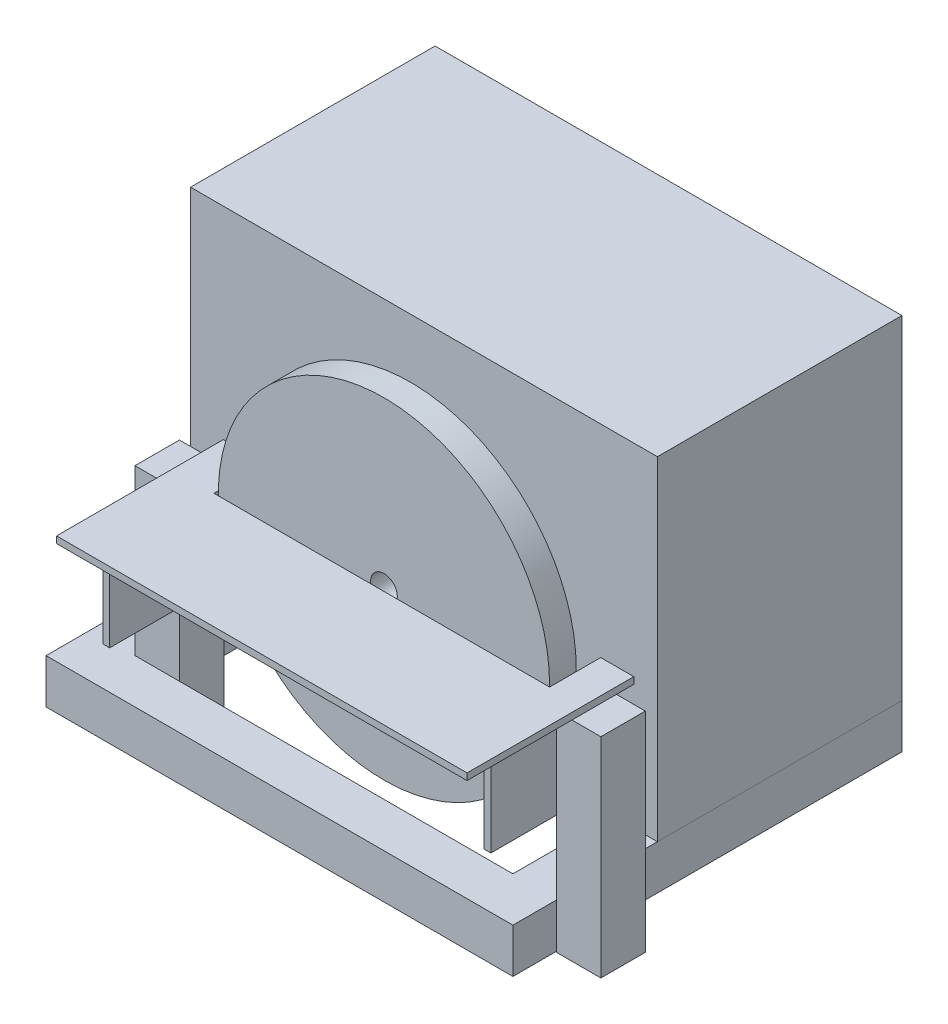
from build123d import *

# Parameters (mm, degrees)
BOSS_EXTRUDE1_DEPTH  = 20
SKETCH2_W            = 210
SKETCH2_H            = 110
BOSS_EXTRUDE2_DEPTH  = 150
SKETCH3_R            = 4
BOSS_EXTRUDE3_DEPTH  = 28
SKETCH4_R            = 18.5
BOSS_EXTRUDE4_DEPTH  = 5
SKETCH5_R            = 6
BOSS_EXTRUDE5_DEPTH  = 2
SKETCH6_R            = 74.5
SKETCH6_R_2          = 6
BOSS_EXTRUDE6_DEPTH  = 12
BOSS_EXTRUDE7_DEPTH  = 3
SKETCH8_W            = 33.700562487
SKETCH8_H            = 8.628747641
BOSS_EXTRUDE8_DEPTH  = 3
SKETCH9_R            = 2.424853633
BOSS_EXTRUDE9_DEPTH  = 3
SKETCH10_W           = 20
SKETCH10_H           = 94
BOSS_EXTRUDE10_DEPTH = 20
SKETCH11_W           = 20
SKETCH11_H           = 74
SKETCH11_H_2         = 20
BOSS_EXTRUDE11_DEPTH = 20
SKETCH12_W           = 68.789404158
SKETCH12_H           = 43.010417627
BOSS_EXTRUDE12_DEPTH = 3
SKETCH13_W           = 22.517146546
SKETCH13_H           = 7.36969842
BOSS_EXTRUDE13_DEPTH = 3


with BuildPart() as part:
    # Sketch1 → Boss-Extrude1 (new body)
    with BuildSketch(Plane(origin=(0, 0, 0), x_dir=(1, 0, 0), z_dir=(0, 1, 0))):
        Polygon((-85, 87.5), (-105, 87.5), (-105, -87.5), (105, -87.5), (105, 87.5), (85, 87.5), (85, 67.5), (85, -67.5), (-85, -67.5), (-85, 67.5), align=None)
    extrude(amount=BOSS_EXTRUDE1_DEPTH)


with BuildPart() as body_2:
    # Sketch2 → Boss-Extrude2 (new body)
    with BuildSketch(Plane(origin=(0, 20, 0), x_dir=(1, 0, 0), z_dir=(0, 1, 0))):
        with Locations((0, 32.5)):
            Rectangle(SKETCH2_W, SKETCH2_H)
    extrude(amount=BOSS_EXTRUDE2_DEPTH)

    # Sketch3 → Boss-Extrude3 (add)
    with BuildSketch(Plane.XY.offset(22.5)):
        with Locations(Location((22, 97, 0), (0, 0, 180))):
            Circle(SKETCH3_R)
    extrude(amount=BOSS_EXTRUDE3_DEPTH)

    # Sketch4 → Boss-Extrude4 (add)
    with BuildSketch(Plane.XY.offset(50.5)):
        with Locations((22, 97)):
            Circle(SKETCH4_R)
    extrude(amount=-BOSS_EXTRUDE4_DEPTH)

    # Sketch5 → Boss-Extrude5 (add)
    with BuildSketch(Plane.XY.offset(50.5)):
        with Locations((22, 97)):
            Circle(SKETCH5_R)
    extrude(amount=BOSS_EXTRUDE5_DEPTH)


with BuildPart() as body_3:
    # Sketch6 → Boss-Extrude6 (new body)
    with BuildSketch(Plane.XY.offset(50.5)):
        with Locations((22, 97)):
            Circle(SKETCH6_R)
        with Locations((22, 97)):
            Circle(SKETCH6_R_2, mode=Mode.SUBTRACT)
    extrude(amount=BOSS_EXTRUDE6_DEPTH)


with BuildPart() as body_4:
    # Sketch7 → Boss-Extrude7 (new body)
    with BuildSketch(Plane(origin=(0, 97, 0), x_dir=(-1, 0, 0), z_dir=(0, -1, 0))):
        Polygon((-97.5, -50.5), (-97.5, -63.5), (53.5, -63.5), (53.5, -50.5), (53.5, -40.5), (72.285706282, -40.5), (72.285706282, -115.5), (-112.376837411, -115.5), (-112.376837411, -40.5), (-97.5, -40.5), align=None)
    extrude(amount=BOSS_EXTRUDE7_DEPTH)

    # Sketch8 → Boss-Extrude8 (add)
    with BuildSketch(Plane(origin=(102.376837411, 0, 0), x_dir=(0, 0, -1), z_dir=(1, 0, 0))):
        with Locations((-86.813472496, 89.68562618)):
            Rectangle(SKETCH8_W, SKETCH8_H)
        with BuildLine():
            ThreePointArc((-97.983063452, 88.940199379), (-99.325759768, 90.282895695), (-97.983063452, 91.625592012))
            Line((-97.983063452, 91.625592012), (-79.855879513, 91.625592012))
            ThreePointArc((-79.855879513, 91.625592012), (-78.513183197, 90.282895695), (-79.855879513, 88.940199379))
            Line((-79.855879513, 88.940199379), (-97.983063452, 88.940199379))
        make_face(mode=Mode.SUBTRACT)
    extrude(amount=-BOSS_EXTRUDE8_DEPTH)


with BuildPart() as body_5:
    # Sketch9 → Boss-Extrude9 (new body)
    with BuildSketch(Plane(origin=(102.376837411, 0, 0), x_dir=(0, 0, -1), z_dir=(1, 0, 0))):
        Polygon((-97.777161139, 94), (-53.694386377, 94), (-53.694386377, 74.433176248), (-38.419296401, 74.433176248), (-38.419296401, 53.42200821), (-53.694386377, 53.42200821), (-97.777161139, 53.42200821), align=None)
        with Locations((-58.118978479, 88.953873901)):
            Circle(SKETCH9_R, mode=Mode.SUBTRACT)
    extrude(amount=BOSS_EXTRUDE9_DEPTH)


with BuildPart() as body_6:
    # Sketch10 → Boss-Extrude10 (new body)
    with BuildSketch(Plane(origin=(105.376837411, 0, 0), x_dir=(0, 0, -1), z_dir=(1, 0, 0))):
        with Locations((-58.305690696, 47)):
            Rectangle(SKETCH10_W, SKETCH10_H)
    extrude(amount=BOSS_EXTRUDE10_DEPTH)


with BuildPart() as body_7:
    # Sketch11 → Boss-Extrude11 (new body)
    with BuildSketch(Plane(origin=(-85, 0, 0), x_dir=(0, 0, -1), z_dir=(1, 0, 0))):
        with Locations((-57.5, 57)):
            Rectangle(SKETCH11_W, SKETCH11_H)
        with Locations((-57.5, 10)):
            Rectangle(SKETCH11_W, SKETCH11_H_2)
    extrude(amount=BOSS_EXTRUDE11_DEPTH)


with BuildPart() as body_8:
    # Sketch12 → Boss-Extrude12 (new body)
    with BuildSketch(Plane(origin=(-65, 0, 0), x_dir=(0, 0, -1), z_dir=(1, 0, 0))):
        with Locations((-67.511894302, 73.230283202)):
            Rectangle(SKETCH12_W, SKETCH12_H)
    extrude(amount=BOSS_EXTRUDE12_DEPTH)


with BuildPart() as body_9:
    # Sketch13 → Boss-Extrude13 (new body)
    with BuildSketch(Plane(origin=(-62, 0, 0), x_dir=(0, 0, -1), z_dir=(1, 0, 0))):
        with Locations((-83.923168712, 91.289710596)):
            Rectangle(SKETCH13_W, SKETCH13_H)
        with BuildLine():
            Line((-91.163637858, 92.977403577), (-76.22903361, 92.977403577))
            ThreePointArc((-76.22903361, 92.977403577), (-75.066718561, 91.815088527), (-76.22903361, 90.652773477))
            Line((-76.22903361, 90.652773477), (-91.163637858, 90.652773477))
            ThreePointArc((-91.163637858, 90.652773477), (-92.325952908, 91.815088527), (-91.163637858, 92.977403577))
        make_face(mode=Mode.SUBTRACT)
    extrude(amount=BOSS_EXTRUDE13_DEPTH)


solid = Compound([part.part, body_2.part, body_3.part, body_4.part, body_5.part, body_6.part, body_7.part, body_8.part, body_9.part])
